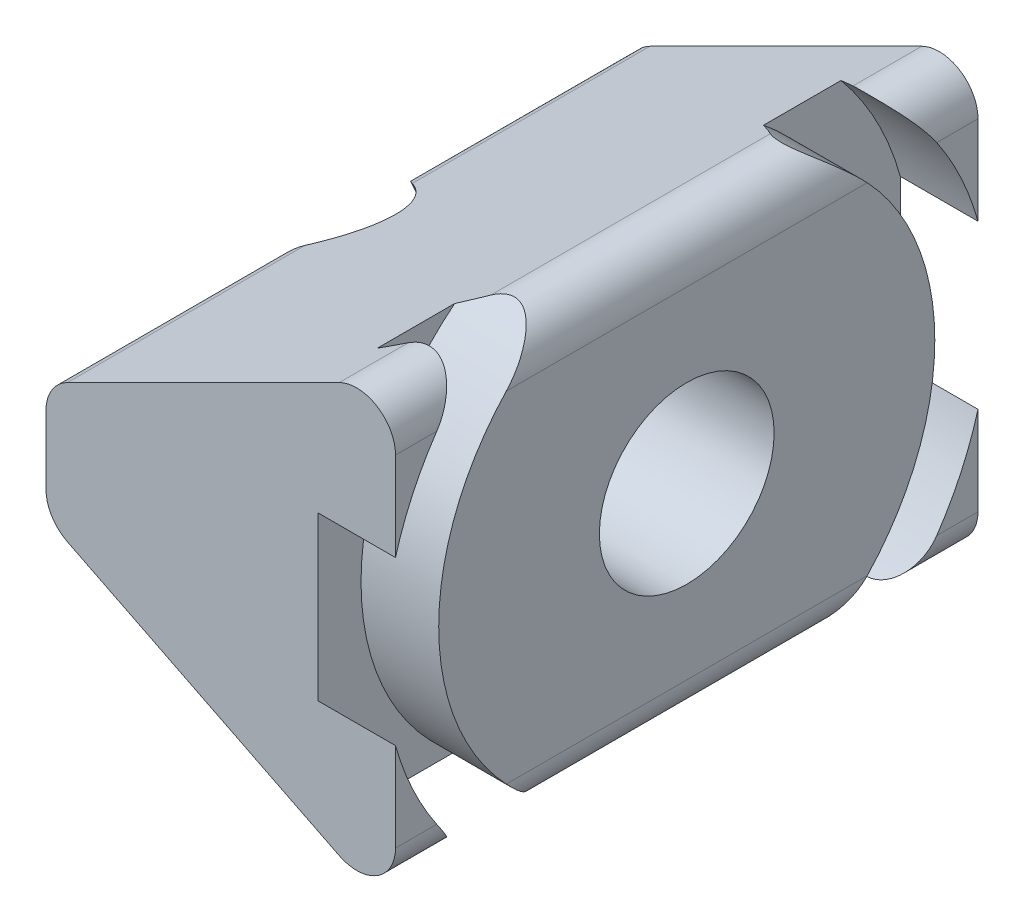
ISO-10303-21;
HEADER;
FILE_DESCRIPTION(('STEP AP214'),'2;1');
FILE_NAME('part.step','',(''),(''),'','','');
FILE_SCHEMA(('AUTOMOTIVE_DESIGN { 1 0 10303 214 1 1 1 1 }'));
ENDSEC;
DATA;
#1=APPLICATION_CONTEXT('core data for automotive mechanical design processes');
#2=APPLICATION_PROTOCOL_DEFINITION('international standard','automotive_design',2000,#1);
#3=PRODUCT_CONTEXT('',#1,'mechanical');
#4=PRODUCT('Part','Part','',(#3));
#5=PRODUCT_RELATED_PRODUCT_CATEGORY('part','',(#4));
#6=PRODUCT_DEFINITION_FORMATION('','',#4);
#7=PRODUCT_DEFINITION_CONTEXT('part definition',#1,'design');
#8=PRODUCT_DEFINITION('design','',#6,#7);
#9=PRODUCT_DEFINITION_SHAPE('','',#8);
#10=(LENGTH_UNIT() NAMED_UNIT(*) SI_UNIT(.MILLI.,.METRE.));
#11=(NAMED_UNIT(*) PLANE_ANGLE_UNIT() SI_UNIT($,.RADIAN.));
#12=(NAMED_UNIT(*) SI_UNIT($,.STERADIAN.) SOLID_ANGLE_UNIT());
#13=UNCERTAINTY_MEASURE_WITH_UNIT(LENGTH_MEASURE(1.E-05),#10,'distance_accuracy_value','');
#14=(GEOMETRIC_REPRESENTATION_CONTEXT(3) GLOBAL_UNCERTAINTY_ASSIGNED_CONTEXT((#13)) GLOBAL_UNIT_ASSIGNED_CONTEXT((#10,
#11,#12)) REPRESENTATION_CONTEXT('',''));
#15=CARTESIAN_POINT('',(0.,0.,0.));
#16=DIRECTION('',(0.,0.,1.));
#17=DIRECTION('',(1.,0.,0.));
#18=AXIS2_PLACEMENT_3D('',#15,#16,#17);
#19=CARTESIAN_POINT('',(-9.,0.,15.));
#20=DIRECTION('',(1.,0.,0.));
#21=DIRECTION('',(0.,0.,-1.));
#22=AXIS2_PLACEMENT_3D('',#19,#20,#21);
#23=PLANE('',#22);
#24=DIRECTION('',(0.,0.,-1.));
#25=VECTOR('',#24,1.);
#26=CARTESIAN_POINT('',(-9.,0.881966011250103,15.));
#27=LINE('',#26,#25);
#28=CARTESIAN_POINT('',(-9.,0.881966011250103,15.));
#29=VERTEX_POINT('',#28);
#30=CARTESIAN_POINT('',(-9.,0.881966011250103,9.56993622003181));
#31=VERTEX_POINT('',#30);
#32=EDGE_CURVE('E237',#29,#31,#27,.T.);
#33=ORIENTED_EDGE('',*,*,#32,.T.);
#34=CARTESIAN_POINT('',(-9.,0.,7.5));
#35=DIRECTION('',(1.,0.,0.));
#36=DIRECTION('',(0.,1.,0.));
#37=AXIS2_PLACEMENT_3D('',#34,#35,#36);
#38=CIRCLE('',#37,2.25);
#39=CARTESIAN_POINT('',(-9.,-0.881966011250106,9.56993622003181));
#40=VERTEX_POINT('',#39);
#41=EDGE_CURVE('E52',#31,#40,#38,.T.);
#42=ORIENTED_EDGE('',*,*,#41,.T.);
#43=DIRECTION('',(0.,0.,-1.));
#44=VECTOR('',#43,1.);
#45=CARTESIAN_POINT('',(-9.,-0.881966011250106,15.));
#46=LINE('',#45,#44);
#47=CARTESIAN_POINT('',(-9.,-0.881966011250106,15.));
#48=VERTEX_POINT('',#47);
#49=EDGE_CURVE('E234',#40,#48,#46,.F.);
#50=ORIENTED_EDGE('',*,*,#49,.T.);
#51=DIRECTION('',(0.,-1.,0.));
#52=VECTOR('',#51,1.);
#53=CARTESIAN_POINT('',(-9.,0.,15.));
#54=LINE('',#53,#52);
#55=EDGE_CURVE('E441',#29,#48,#54,.T.);
#56=ORIENTED_EDGE('',*,*,#55,.F.);
#57=EDGE_LOOP('',(#33,#42,#50,#56));
#58=FACE_BOUND('',#57,.T.);
#59=ADVANCED_FACE('F31',(#58),#23,.F.);
#60=CARTESIAN_POINT('',(-8.,-0.881966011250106,15.));
#61=DIRECTION('',(0.,0.,1.));
#62=DIRECTION('',(1.,0.,0.));
#63=AXIS2_PLACEMENT_3D('',#60,#61,#62);
#64=CYLINDRICAL_SURFACE('',#63,1.);
#65=CARTESIAN_POINT('',(-8.44721359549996,-1.77639320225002,8.8809153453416));
#66=CARTESIAN_POINT('',(-8.48022546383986,-1.75985632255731,8.90220934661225));
#67=CARTESIAN_POINT('',(-8.5117373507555,-1.74184496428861,8.92457038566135));
#68=CARTESIAN_POINT('',(-8.57188576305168,-1.70308703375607,8.97067460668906));
#69=CARTESIAN_POINT('',(-8.6005253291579,-1.68234340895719,8.99441628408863));
#70=CARTESIAN_POINT('',(-8.65530812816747,-1.63814967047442,9.04274124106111));
#71=CARTESIAN_POINT('',(-8.68143318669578,-1.61468221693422,9.06732912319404));
#72=CARTESIAN_POINT('',(-8.73099497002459,-1.56524652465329,9.11670184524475));
#73=CARTESIAN_POINT('',(-8.7544309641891,-1.53927760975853,9.14148673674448));
#74=CARTESIAN_POINT('',(-8.81656464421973,-1.46271400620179,9.21096514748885));
#75=CARTESIAN_POINT('',(-8.85213696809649,-1.40929609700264,9.25542425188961));
#76=CARTESIAN_POINT('',(-8.91295974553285,-1.29507931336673,9.34129004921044));
#77=CARTESIAN_POINT('',(-8.93825899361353,-1.23431715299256,9.38271038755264));
#78=CARTESIAN_POINT('',(-8.97112487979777,-1.12513805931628,9.44919122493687));
#79=CARTESIAN_POINT('',(-8.98172220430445,-1.07837749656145,9.47546969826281));
#80=CARTESIAN_POINT('',(-8.99617759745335,-0.982054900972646,9.5251076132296));
#81=CARTESIAN_POINT('',(-9.00000219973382,-0.932480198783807,9.54845203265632));
#82=CARTESIAN_POINT('',(-9.,-0.881966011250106,9.56993622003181));
#83=B_SPLINE_CURVE_WITH_KNOTS('',3,(#65,#66,#67,#68,#69,#70,#71,#72,#73,#74,#75,#76,#77,#78,#79,
#80,#81,#82),.UNSPECIFIED.,.F.,.F.,(4,2,2,2,2,2,2,2,4),(0.,0.127720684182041,0.255304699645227,
0.383750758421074,0.512231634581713,0.745406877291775,0.977461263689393,1.14095718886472,
1.30525877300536),.UNSPECIFIED.);
#84=CARTESIAN_POINT('',(-8.44721359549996,-1.77639320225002,8.8809153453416));
#85=VERTEX_POINT('',#84);
#86=EDGE_CURVE('E220',#85,#40,#83,.T.);
#87=ORIENTED_EDGE('',*,*,#86,.F.);
#88=DIRECTION('',(0.,0.,-1.));
#89=VECTOR('',#88,1.);
#90=CARTESIAN_POINT('',(-8.44721359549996,-1.77639320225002,0.));
#91=LINE('',#90,#89);
#92=CARTESIAN_POINT('',(-8.44721359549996,-1.77639320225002,15.));
#93=VERTEX_POINT('',#92);
#94=EDGE_CURVE('E453',#93,#85,#91,.T.);
#95=ORIENTED_EDGE('',*,*,#94,.F.);
#96=CARTESIAN_POINT('',(-8.,-0.881966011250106,15.));
#97=DIRECTION('',(0.,0.,-1.));
#98=DIRECTION('',(-1.,0.,0.));
#99=AXIS2_PLACEMENT_3D('',#96,#97,#98);
#100=CIRCLE('',#99,1.);
#101=EDGE_CURVE('E243',#48,#93,#100,.F.);
#102=ORIENTED_EDGE('',*,*,#101,.F.);
#103=ORIENTED_EDGE('',*,*,#49,.F.);
#104=EDGE_LOOP('',(#87,#95,#102,#103));
#105=FACE_BOUND('',#104,.T.);
#106=ADVANCED_FACE('F242',(#105),#64,.T.);
#107=CARTESIAN_POINT('',(-8.,0.881966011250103,15.));
#108=DIRECTION('',(0.,0.,-1.));
#109=DIRECTION('',(-1.,0.,0.));
#110=AXIS2_PLACEMENT_3D('',#107,#108,#109);
#111=CYLINDRICAL_SURFACE('',#110,1.);
#112=CARTESIAN_POINT('',(-8.44721359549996,1.77639320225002,6.1190846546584));
#113=CARTESIAN_POINT('',(-8.48022546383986,1.75985632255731,6.09779065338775));
#114=CARTESIAN_POINT('',(-8.5117373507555,1.7418449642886,6.07542961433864));
#115=CARTESIAN_POINT('',(-8.57188576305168,1.70308703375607,6.02932539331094));
#116=CARTESIAN_POINT('',(-8.6005253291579,1.68234340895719,6.00558371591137));
#117=CARTESIAN_POINT('',(-8.65530812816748,1.63814967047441,5.95725875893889));
#118=CARTESIAN_POINT('',(-8.68143318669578,1.61468221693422,5.93267087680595));
#119=CARTESIAN_POINT('',(-8.73099497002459,1.56524652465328,5.88329815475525));
#120=CARTESIAN_POINT('',(-8.75443096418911,1.53927760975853,5.85851326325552));
#121=CARTESIAN_POINT('',(-8.81656464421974,1.46271400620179,5.78903485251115));
#122=CARTESIAN_POINT('',(-8.85213696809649,1.40929609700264,5.74457574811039));
#123=CARTESIAN_POINT('',(-8.91295974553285,1.29507931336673,5.65870995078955));
#124=CARTESIAN_POINT('',(-8.93825899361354,1.23431715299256,5.61728961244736));
#125=CARTESIAN_POINT('',(-8.97112487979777,1.12513805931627,5.55080877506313));
#126=CARTESIAN_POINT('',(-8.98172220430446,1.07837749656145,5.52453030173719));
#127=CARTESIAN_POINT('',(-8.99617759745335,0.982054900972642,5.4748923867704));
#128=CARTESIAN_POINT('',(-9.00000219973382,0.932480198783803,5.45154796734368));
#129=CARTESIAN_POINT('',(-9.,0.881966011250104,5.43006377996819));
#130=B_SPLINE_CURVE_WITH_KNOTS('',3,(#112,#113,#114,#115,#116,#117,#118,#119,#120,#121,#122,
#123,#124,#125,#126,#127,#128,#129),.UNSPECIFIED.,.F.,.F.,(4,2,2,2,2,2,2,2,4),(0.,
0.127720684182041,0.255304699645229,0.383750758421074,0.512231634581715,0.745406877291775,
0.977461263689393,1.14095718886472,1.30525877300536),.UNSPECIFIED.);
#131=CARTESIAN_POINT('',(-8.44721359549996,1.77639320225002,6.1190846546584));
#132=VERTEX_POINT('',#131);
#133=CARTESIAN_POINT('',(-9.,0.881966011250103,5.43006377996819));
#134=VERTEX_POINT('',#133);
#135=EDGE_CURVE('E11',#132,#134,#130,.T.);
#136=ORIENTED_EDGE('',*,*,#135,.F.);
#137=DIRECTION('',(0.,0.,-1.));
#138=VECTOR('',#137,1.);
#139=CARTESIAN_POINT('',(-8.44721359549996,1.77639320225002,15.));
#140=LINE('',#139,#138);
#141=CARTESIAN_POINT('',(-8.44721359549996,1.77639320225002,0.));
#142=VERTEX_POINT('',#141);
#143=EDGE_CURVE('E264',#142,#132,#140,.F.);
#144=ORIENTED_EDGE('',*,*,#143,.F.);
#145=CARTESIAN_POINT('',(-8.,0.881966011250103,0.));
#146=DIRECTION('',(0.,0.,-1.));
#147=DIRECTION('',(-1.,0.,0.));
#148=AXIS2_PLACEMENT_3D('',#145,#146,#147);
#149=CIRCLE('',#148,1.);
#150=CARTESIAN_POINT('',(-9.,0.881966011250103,0.));
#151=VERTEX_POINT('',#150);
#152=EDGE_CURVE('E460',#151,#142,#149,.T.);
#153=ORIENTED_EDGE('',*,*,#152,.F.);
#154=EDGE_CURVE('E248',#134,#151,#27,.T.);
#155=ORIENTED_EDGE('',*,*,#154,.F.);
#156=EDGE_LOOP('',(#136,#144,#153,#155));
#157=FACE_BOUND('',#156,.T.);
#158=ADVANCED_FACE('F474',(#157),#111,.T.);
#159=CARTESIAN_POINT('',(0.,6.,15.));
#160=DIRECTION('',(-1.,0.,0.));
#161=DIRECTION('',(0.,-1.,0.));
#162=AXIS2_PLACEMENT_3D('',#159,#160,#161);
#163=PLANE('',#162);
#164=DIRECTION('',(0.,0.,-1.));
#165=VECTOR('',#164,1.);
#166=CARTESIAN_POINT('',(0.,-4.3819660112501,0.));
#167=LINE('',#166,#165);
#168=CARTESIAN_POINT('',(0.,-4.3819660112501,15.));
#169=VERTEX_POINT('',#168);
#170=CARTESIAN_POINT('',(0.,-4.3819660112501,13.9376359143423));
#171=VERTEX_POINT('',#170);
#172=EDGE_CURVE('E273',#169,#171,#167,.T.);
#173=ORIENTED_EDGE('',*,*,#172,.T.);
#174=CARTESIAN_POINT('',(0.,0.,7.5));
#175=DIRECTION('',(1.,0.,0.));
#176=DIRECTION('',(0.,1.,0.));
#177=AXIS2_PLACEMENT_3D('',#174,#175,#176);
#178=CIRCLE('',#177,7.78747598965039);
#179=CARTESIAN_POINT('',(0.,-2.09637360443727,15.));
#180=VERTEX_POINT('',#179);
#181=EDGE_CURVE('E404',#180,#171,#178,.T.);
#182=ORIENTED_EDGE('',*,*,#181,.F.);
#183=DIRECTION('',(0.,1.,0.));
#184=VECTOR('',#183,1.);
#185=CARTESIAN_POINT('',(0.,6.,15.));
#186=LINE('',#185,#184);
#187=EDGE_CURVE('E510',#169,#180,#186,.T.);
#188=ORIENTED_EDGE('',*,*,#187,.F.);
#189=EDGE_LOOP('',(#173,#182,#188));
#190=FACE_BOUND('',#189,.T.);
#191=ADVANCED_FACE('F556',(#190),#163,.F.);
#192=DIRECTION('',(0.,0.,-1.));
#193=VECTOR('',#192,1.);
#194=CARTESIAN_POINT('',(0.,4.38196601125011,15.));
#195=LINE('',#194,#193);
#196=CARTESIAN_POINT('',(0.,4.38196601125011,0.));
#197=VERTEX_POINT('',#196);
#198=CARTESIAN_POINT('',(0.,4.38196601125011,1.06236408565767));
#199=VERTEX_POINT('',#198);
#200=EDGE_CURVE('E268',#197,#199,#195,.F.);
#201=ORIENTED_EDGE('',*,*,#200,.T.);
#202=CARTESIAN_POINT('',(0.,2.09637360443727,0.));
#203=VERTEX_POINT('',#202);
#204=EDGE_CURVE('E388',#203,#199,#178,.T.);
#205=ORIENTED_EDGE('',*,*,#204,.F.);
#206=DIRECTION('',(0.,1.,0.));
#207=VECTOR('',#206,1.);
#208=CARTESIAN_POINT('',(0.,6.,0.));
#209=LINE('',#208,#207);
#210=EDGE_CURVE('E434',#203,#197,#209,.T.);
#211=ORIENTED_EDGE('',*,*,#210,.T.);
#212=EDGE_LOOP('',(#201,#205,#211));
#213=FACE_BOUND('',#212,.T.);
#214=ADVANCED_FACE('F489',(#213),#163,.F.);
#215=CARTESIAN_POINT('',(0.,0.,7.5));
#216=DIRECTION('',(1.,0.,0.));
#217=DIRECTION('',(0.,1.,0.));
#218=AXIS2_PLACEMENT_3D('',#215,#216,#217);
#219=CIRCLE('',#218,2.25);
#220=CARTESIAN_POINT('',(0.,2.25,7.5));
#221=VERTEX_POINT('',#220);
#222=EDGE_CURVE('E582',#221,#221,#219,.T.);
#223=ORIENTED_EDGE('',*,*,#222,.F.);
#224=EDGE_LOOP('',(#223));
#225=FACE_BOUND('',#224,.T.);
#226=CARTESIAN_POINT('',(0.,0.,7.5));
#227=DIRECTION('',(1.,0.,0.));
#228=DIRECTION('',(0.,1.,0.));
#229=AXIS2_PLACEMENT_3D('',#226,#227,#228);
#230=CIRCLE('',#229,6.38747598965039);
#231=CARTESIAN_POINT('',(0.,4.38196601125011,12.1473888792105));
#232=VERTEX_POINT('',#231);
#233=CARTESIAN_POINT('',(0.,-4.3819660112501,12.1473888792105));
#234=VERTEX_POINT('',#233);
#235=EDGE_CURVE('E393',#232,#234,#230,.T.);
#236=ORIENTED_EDGE('',*,*,#235,.T.);
#237=CARTESIAN_POINT('',(0.,-4.3819660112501,2.85261112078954));
#238=VERTEX_POINT('',#237);
#239=EDGE_CURVE('E277',#234,#238,#167,.T.);
#240=ORIENTED_EDGE('',*,*,#239,.T.);
#241=CARTESIAN_POINT('',(0.,4.38196601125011,2.85261112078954));
#242=VERTEX_POINT('',#241);
#243=EDGE_CURVE('E229',#238,#242,#230,.T.);
#244=ORIENTED_EDGE('',*,*,#243,.T.);
#245=EDGE_CURVE('E272',#242,#232,#195,.F.);
#246=ORIENTED_EDGE('',*,*,#245,.T.);
#247=EDGE_LOOP('',(#236,#240,#244,#246));
#248=FACE_BOUND('',#247,.T.);
#249=ADVANCED_FACE('F541',(#225,#248),#163,.F.);
#250=CARTESIAN_POINT('',(0.,2.09637360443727,15.));
#251=VERTEX_POINT('',#250);
#252=CARTESIAN_POINT('',(0.,4.38196601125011,15.));
#253=VERTEX_POINT('',#252);
#254=EDGE_CURVE('E446',#251,#253,#186,.T.);
#255=ORIENTED_EDGE('',*,*,#254,.F.);
#256=CARTESIAN_POINT('',(0.,4.38196601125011,13.9376359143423));
#257=VERTEX_POINT('',#256);
#258=EDGE_CURVE('E392',#257,#251,#178,.T.);
#259=ORIENTED_EDGE('',*,*,#258,.F.);
#260=EDGE_CURVE('E267',#257,#253,#195,.F.);
#261=ORIENTED_EDGE('',*,*,#260,.T.);
#262=EDGE_LOOP('',(#255,#259,#261));
#263=FACE_BOUND('',#262,.T.);
#264=ADVANCED_FACE('F544',(#263),#163,.F.);
#265=CARTESIAN_POINT('',(-1.,-4.3819660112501,15.));
#266=DIRECTION('',(0.,0.,1.));
#267=DIRECTION('',(1.,0.,0.));
#268=AXIS2_PLACEMENT_3D('',#265,#266,#267);
#269=CYLINDRICAL_SURFACE('',#268,1.);
#270=ORIENTED_EDGE('',*,*,#239,.F.);
#271=CARTESIAN_POINT('',(0.,-4.3819660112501,12.1473888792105));
#272=CARTESIAN_POINT('',(-1.24990088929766E-05,-4.421813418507,12.1098257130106));
#273=CARTESIAN_POINT('',(-0.00238111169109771,-4.46115226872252,12.0717575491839));
#274=CARTESIAN_POINT('',(-0.0115664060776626,-4.5385668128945,11.9949096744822));
#275=CARTESIAN_POINT('',(-0.0183811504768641,-4.57664304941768,11.9561302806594));
#276=CARTESIAN_POINT('',(-0.0363107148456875,-4.65180644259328,11.8776185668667));
#277=CARTESIAN_POINT('',(-0.0474802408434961,-4.68887432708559,11.8378804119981));
#278=CARTESIAN_POINT('',(-0.0739455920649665,-4.76132229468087,11.7582339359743));
#279=CARTESIAN_POINT('',(-0.0892418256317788,-4.79670221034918,11.7183255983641));
#280=CARTESIAN_POINT('',(-0.124071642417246,-4.86597973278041,11.6382272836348));
#281=CARTESIAN_POINT('',(-0.143649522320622,-4.89985702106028,11.5980389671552));
#282=CARTESIAN_POINT('',(-0.186978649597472,-4.96552754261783,11.5182154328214));
#283=CARTESIAN_POINT('',(-0.210729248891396,-4.99732109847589,11.4785801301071));
#284=CARTESIAN_POINT('',(-0.262441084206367,-5.05842794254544,11.4005892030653));
#285=CARTESIAN_POINT('',(-0.290378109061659,-5.0877540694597,11.3622276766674));
#286=CARTESIAN_POINT('',(-0.350875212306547,-5.14376354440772,11.2873112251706));
#287=CARTESIAN_POINT('',(-0.383429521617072,-5.17045012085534,11.2507541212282));
#288=CARTESIAN_POINT('',(-0.447600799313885,-5.21630862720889,11.1866309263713));
#289=CARTESIAN_POINT('',(-0.478396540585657,-5.23598036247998,11.1586067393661));
#290=CARTESIAN_POINT('',(-0.543943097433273,-5.27270958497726,11.1054715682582));
#291=CARTESIAN_POINT('',(-0.578697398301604,-5.28976473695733,11.0803631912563));
#292=CARTESIAN_POINT('',(-0.653007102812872,-5.32071065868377,11.0342141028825));
#293=CARTESIAN_POINT('',(-0.692626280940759,-5.33455053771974,11.0132395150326));
#294=CARTESIAN_POINT('',(-0.776043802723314,-5.35751236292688,10.9781257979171));
#295=CARTESIAN_POINT('',(-0.819825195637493,-5.36665254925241,10.9639602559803));
#296=CARTESIAN_POINT('',(-0.895009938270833,-5.37690311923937,10.9480166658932));
#297=CARTESIAN_POINT('',(-0.925646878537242,-5.37967769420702,10.9436785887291));
#298=CARTESIAN_POINT('',(-0.987321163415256,-5.38235979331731,10.9394854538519));
#299=CARTESIAN_POINT('',(-1.01835781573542,-5.38227174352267,10.9396234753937));
#300=CARTESIAN_POINT('',(-1.07985143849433,-5.37924755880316,10.9443506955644));
#301=CARTESIAN_POINT('',(-1.11030973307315,-5.37631901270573,10.9489280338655));
#302=CARTESIAN_POINT('',(-1.1700914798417,-5.36785925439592,10.9620799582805));
#303=CARTESIAN_POINT('',(-1.1994093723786,-5.36231669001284,10.9706719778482));
#304=CARTESIAN_POINT('',(-1.26832437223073,-5.34619221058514,10.9954788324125));
#305=CARTESIAN_POINT('',(-1.30702894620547,-5.33447050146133,11.0133806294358));
#306=CARTESIAN_POINT('',(-1.38021440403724,-5.30767787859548,11.053731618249));
#307=CARTESIAN_POINT('',(-1.41473432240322,-5.29264232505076,11.0761325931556));
#308=CARTESIAN_POINT('',(-1.44721359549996,-5.27639320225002,11.0999339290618));
#309=B_SPLINE_CURVE_WITH_KNOTS('',3,(#271,#272,#273,#274,#275,#276,#277,#278,#279,#280,#281,
#282,#283,#284,#285,#286,#287,#288,#289,#290,#291,#292,#293,#294,#295,#296,#297,#298,#299,#300,
#301,#302,#303,#304,#305,#306,#307,#308),.UNSPECIFIED.,.F.,.F.,(4,2,2,2,2,2,2,2,2,2,2,2,2,2,2,2,
2,2,4),(0.,0.164195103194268,0.328318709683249,0.494574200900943,0.660846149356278,
0.828927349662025,0.996982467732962,1.16410072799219,1.33101199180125,1.46890142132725,
1.60691320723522,1.74697967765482,1.886498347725,1.97928083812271,2.0719198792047,
2.16431210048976,2.2571093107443,2.38912662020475,2.51979813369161),.UNSPECIFIED.);
#310=CARTESIAN_POINT('',(-1.44721359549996,-5.27639320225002,11.0999339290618));
#311=VERTEX_POINT('',#310);
#312=EDGE_CURVE('E328',#234,#311,#309,.T.);
#313=ORIENTED_EDGE('',*,*,#312,.T.);
#314=DIRECTION('',(0.,0.,-1.));
#315=VECTOR('',#314,1.);
#316=CARTESIAN_POINT('',(-1.44721359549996,-5.27639320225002,15.));
#317=LINE('',#316,#315);
#318=CARTESIAN_POINT('',(-1.44721359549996,-5.27639320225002,3.90006607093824));
#319=VERTEX_POINT('',#318);
#320=EDGE_CURVE('E451',#319,#311,#317,.F.);
#321=ORIENTED_EDGE('',*,*,#320,.F.);
#322=CARTESIAN_POINT('',(-1.44721359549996,-5.27639320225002,3.90006607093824));
#323=CARTESIAN_POINT('',(-1.41906915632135,-5.29045968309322,3.92067424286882));
#324=CARTESIAN_POINT('',(-1.38947830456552,-5.30359780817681,3.9401999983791));
#325=CARTESIAN_POINT('',(-1.32703524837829,-5.32758049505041,3.97619600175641));
#326=CARTESIAN_POINT('',(-1.29414303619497,-5.33839020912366,3.99261942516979));
#327=CARTESIAN_POINT('',(-1.2252545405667,-5.35692115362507,4.0209857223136));
#328=CARTESIAN_POINT('',(-1.18923594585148,-5.36461750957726,4.03289246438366));
#329=CARTESIAN_POINT('',(-1.11529566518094,-5.37599370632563,4.05055718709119));
#330=CARTESIAN_POINT('',(-1.07738771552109,-5.37969907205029,4.05635423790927));
#331=CARTESIAN_POINT('',(-1.0053957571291,-5.38252373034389,4.06077145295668));
#332=CARTESIAN_POINT('',(-0.971376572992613,-5.38212387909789,4.06014414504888));
#333=CARTESIAN_POINT('',(-0.904025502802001,-5.37792321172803,4.05358076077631));
#334=CARTESIAN_POINT('',(-0.870695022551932,-5.37411603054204,4.04763474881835));
#335=CARTESIAN_POINT('',(-0.801257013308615,-5.36273404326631,4.02997768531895));
#336=CARTESIAN_POINT('',(-0.76540104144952,-5.35471179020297,4.01758426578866));
#337=CARTESIAN_POINT('',(-0.696562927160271,-5.33549052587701,3.98820580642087));
#338=CARTESIAN_POINT('',(-0.663585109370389,-5.32428683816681,3.97121400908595));
#339=CARTESIAN_POINT('',(-0.583889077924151,-5.29275919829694,3.92400840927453));
#340=CARTESIAN_POINT('',(-0.539176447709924,-5.27075181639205,3.89156548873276));
#341=CARTESIAN_POINT('',(-0.456094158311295,-5.22249188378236,3.82206128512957));
#342=CARTESIAN_POINT('',(-0.41774182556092,-5.1962281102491,3.78498785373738));
#343=CARTESIAN_POINT('',(-0.353036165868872,-5.1453859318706,3.71497964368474));
#344=CARTESIAN_POINT('',(-0.325763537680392,-5.1213459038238,3.68249018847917));
#345=CARTESIAN_POINT('',(-0.274696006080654,-5.07132210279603,3.61628153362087));
#346=CARTESIAN_POINT('',(-0.250903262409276,-5.04533713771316,3.58256158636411));
#347=CARTESIAN_POINT('',(-0.184367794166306,-4.96472912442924,3.48019530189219));
#348=CARTESIAN_POINT('',(-0.146507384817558,-4.90748519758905,3.41038744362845));
#349=CARTESIAN_POINT('',(-0.0817528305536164,-4.78431989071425,3.26685247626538));
#350=CARTESIAN_POINT('',(-0.0554728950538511,-4.71811375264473,3.19309819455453));
#351=CARTESIAN_POINT('',(-0.0173182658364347,-4.58048285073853,3.04702168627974));
#352=CARTESIAN_POINT('',(-0.00539673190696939,-4.50907586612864,2.97469556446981));
#353=CARTESIAN_POINT('',(-0.000490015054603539,-4.41797436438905,2.88675988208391));
#354=CARTESIAN_POINT('',(-2.18269841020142E-06,-4.40001886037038,2.86963014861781));
#355=CARTESIAN_POINT('',(0.,-4.3819660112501,2.85261112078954));
#356=B_SPLINE_CURVE_WITH_KNOTS('',3,(#322,#323,#324,#325,#326,#327,#328,#329,#330,#331,#332,
#333,#334,#335,#336,#337,#338,#339,#340,#341,#342,#343,#344,#345,#346,#347,#348,#349,#350,#351,
#352,#353,#354,#355),.UNSPECIFIED.,.F.,.F.,(4,2,2,2,2,2,2,2,2,2,2,2,2,2,2,2,4),(0.,
0.113000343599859,0.227589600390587,0.343077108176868,0.457821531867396,0.559294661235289,
0.660957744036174,0.776651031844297,0.89251526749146,1.06992123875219,1.24780282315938,
1.39387727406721,1.54004200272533,1.83257311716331,2.13915771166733,2.44473942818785,
2.51918204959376),.UNSPECIFIED.);
#357=EDGE_CURVE('E305',#319,#238,#356,.T.);
#358=ORIENTED_EDGE('',*,*,#357,.T.);
#359=EDGE_LOOP('',(#270,#313,#321,#358));
#360=FACE_BOUND('',#359,.T.);
#361=ADVANCED_FACE('F320',(#360),#269,.T.);
#362=CARTESIAN_POINT('',(0.,-4.3819660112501,13.9376359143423));
#363=CARTESIAN_POINT('',(-5.60146233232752E-06,-4.41701432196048,13.9137814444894));
#364=CARTESIAN_POINT('',(-0.00184259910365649,-4.45184148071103,13.8896537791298));
#365=CARTESIAN_POINT('',(-0.00908203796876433,-4.52084686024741,13.8410175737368));
#366=CARTESIAN_POINT('',(-0.0144839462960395,-4.55502517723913,13.8165090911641));
#367=CARTESIAN_POINT('',(-0.0359619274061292,-4.65662390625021,13.7424081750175));
#368=CARTESIAN_POINT('',(-0.057308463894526,-4.72276023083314,13.6924774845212));
#369=CARTESIAN_POINT('',(-0.113099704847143,-4.84900477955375,13.5941186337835));
#370=CARTESIAN_POINT('',(-0.147386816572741,-4.90917494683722,13.5456796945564));
#371=CARTESIAN_POINT('',(-0.22896742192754,-5.02256464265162,13.451806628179));
#372=CARTESIAN_POINT('',(-0.27622724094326,-5.07580164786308,13.4063650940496));
#373=CARTESIAN_POINT('',(-0.366282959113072,-5.15706947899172,13.3353511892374));
#374=CARTESIAN_POINT('',(-0.405494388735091,-5.18765351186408,13.3081371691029));
#375=CARTESIAN_POINT('',(-0.489844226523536,-5.24352871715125,13.2577422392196));
#376=CARTESIAN_POINT('',(-0.534972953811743,-5.26882836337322,13.2345548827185));
#377=CARTESIAN_POINT('',(-0.621445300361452,-5.30851869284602,13.1978066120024));
#378=CARTESIAN_POINT('',(-0.66182720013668,-5.32407334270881,13.1832509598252));
#379=CARTESIAN_POINT('',(-0.745568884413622,-5.35004731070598,13.1588069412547));
#380=CARTESIAN_POINT('',(-0.78892660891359,-5.36047014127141,13.148915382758));
#381=CARTESIAN_POINT('',(-0.877845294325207,-5.37550627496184,13.1346097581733));
#382=CARTESIAN_POINT('',(-0.923418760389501,-5.38008131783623,13.1302317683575));
#383=CARTESIAN_POINT('',(-1.01493501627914,-5.38290041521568,13.1275368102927));
#384=CARTESIAN_POINT('',(-1.06087765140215,-5.3811469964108,13.1292174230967));
#385=CARTESIAN_POINT('',(-1.14676174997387,-5.37198259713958,13.1379621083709));
#386=CARTESIAN_POINT('',(-1.18683150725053,-5.36517711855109,13.1444498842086));
#387=CARTESIAN_POINT('',(-1.26500636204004,-5.34704711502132,13.1616272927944));
#388=CARTESIAN_POINT('',(-1.30311070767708,-5.33572087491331,13.1723185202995));
#389=CARTESIAN_POINT('',(-1.35850285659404,-5.31570572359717,13.1910578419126));
#390=CARTESIAN_POINT('',(-1.37678891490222,-5.30847100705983,13.1978090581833));
#391=CARTESIAN_POINT('',(-1.41257770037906,-5.29309546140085,13.212095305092));
#392=CARTESIAN_POINT('',(-1.43008288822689,-5.28495780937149,13.2196275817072));
#393=CARTESIAN_POINT('',(-1.44721359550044,-5.27639320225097,13.2275175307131));
#394=B_SPLINE_CURVE_WITH_KNOTS('',3,(#362,#363,#364,#365,#366,#367,#368,#369,#370,#371,#372,
#373,#374,#375,#376,#377,#378,#379,#380,#381,#382,#383,#384,#385,#386,#387,#388,#389,#390,#391,
#392,#393),.UNSPECIFIED.,.F.,.F.,(4,2,2,2,2,2,2,2,2,2,2,2,2,2,2,4),(0.,0.127093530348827,
0.254168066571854,0.509564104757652,0.761945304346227,1.01367746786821,1.18318155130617,
1.35241170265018,1.48884123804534,1.62517726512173,1.76240080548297,1.89956956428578,
2.02251490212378,2.14550692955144,2.20784130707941,2.26996292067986),.UNSPECIFIED.);
#395=CARTESIAN_POINT('',(-1.44721359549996,-5.27639320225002,13.2275175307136));
#396=VERTEX_POINT('',#395);
#397=EDGE_CURVE('E601',#171,#396,#394,.T.);
#398=ORIENTED_EDGE('',*,*,#397,.F.);
#399=ORIENTED_EDGE('',*,*,#172,.F.);
#400=CARTESIAN_POINT('',(-1.,-4.3819660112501,15.));
#401=DIRECTION('',(0.,0.,-1.));
#402=DIRECTION('',(-1.,0.,0.));
#403=AXIS2_PLACEMENT_3D('',#400,#401,#402);
#404=CIRCLE('',#403,1.);
#405=CARTESIAN_POINT('',(-1.44721359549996,-5.27639320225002,15.));
#406=VERTEX_POINT('',#405);
#407=EDGE_CURVE('E253',#406,#169,#404,.F.);
#408=ORIENTED_EDGE('',*,*,#407,.F.);
#409=EDGE_CURVE('E452',#396,#406,#317,.F.);
#410=ORIENTED_EDGE('',*,*,#409,.F.);
#411=EDGE_LOOP('',(#398,#399,#408,#410));
#412=FACE_BOUND('',#411,.T.);
#413=ADVANCED_FACE('F321',(#412),#269,.T.);
#414=CARTESIAN_POINT('',(-1.,4.38196601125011,15.));
#415=DIRECTION('',(0.,0.,-1.));
#416=DIRECTION('',(-1.,0.,0.));
#417=AXIS2_PLACEMENT_3D('',#414,#415,#416);
#418=CYLINDRICAL_SURFACE('',#417,1.);
#419=ORIENTED_EDGE('',*,*,#245,.F.);
#420=CARTESIAN_POINT('',(0.,4.38196601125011,2.85261112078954));
#421=CARTESIAN_POINT('',(-1.24990088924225E-05,4.421813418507,2.8901742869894));
#422=CARTESIAN_POINT('',(-0.00238111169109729,4.46115226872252,2.92824245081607));
#423=CARTESIAN_POINT('',(-0.0115664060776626,4.5385668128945,3.00509032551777));
#424=CARTESIAN_POINT('',(-0.0183811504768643,4.57664304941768,3.04386971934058));
#425=CARTESIAN_POINT('',(-0.0363107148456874,4.65180644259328,3.12238143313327));
#426=CARTESIAN_POINT('',(-0.0474802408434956,4.68887432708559,3.16211958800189));
#427=CARTESIAN_POINT('',(-0.0739455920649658,4.76132229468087,3.24176606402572));
#428=CARTESIAN_POINT('',(-0.0892418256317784,4.79670221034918,3.2816744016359));
#429=CARTESIAN_POINT('',(-0.124071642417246,4.86597973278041,3.36177271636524));
#430=CARTESIAN_POINT('',(-0.143649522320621,4.89985702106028,3.40196103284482));
#431=CARTESIAN_POINT('',(-0.186978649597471,4.96552754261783,3.48178456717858));
#432=CARTESIAN_POINT('',(-0.210729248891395,4.99732109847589,3.52141986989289));
#433=CARTESIAN_POINT('',(-0.262441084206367,5.05842794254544,3.59941079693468));
#434=CARTESIAN_POINT('',(-0.290378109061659,5.0877540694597,3.63777232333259));
#435=CARTESIAN_POINT('',(-0.350875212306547,5.14376354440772,3.71268877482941));
#436=CARTESIAN_POINT('',(-0.383429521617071,5.17045012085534,3.74924587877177));
#437=CARTESIAN_POINT('',(-0.447600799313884,5.21630862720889,3.81336907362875));
#438=CARTESIAN_POINT('',(-0.478396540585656,5.23598036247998,3.8413932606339));
#439=CARTESIAN_POINT('',(-0.543943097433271,5.27270958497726,3.89452843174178));
#440=CARTESIAN_POINT('',(-0.578697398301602,5.28976473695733,3.91963680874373));
#441=CARTESIAN_POINT('',(-0.65300710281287,5.32071065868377,3.96578589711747));
#442=CARTESIAN_POINT('',(-0.692626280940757,5.33455053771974,3.98676048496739));
#443=CARTESIAN_POINT('',(-0.776043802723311,5.35751236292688,4.02187420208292));
#444=CARTESIAN_POINT('',(-0.819825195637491,5.36665254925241,4.03603974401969));
#445=CARTESIAN_POINT('',(-0.89500993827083,5.37690311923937,4.05198333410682));
#446=CARTESIAN_POINT('',(-0.925646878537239,5.37967769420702,4.05632141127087));
#447=CARTESIAN_POINT('',(-0.987321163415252,5.38235979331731,4.06051454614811));
#448=CARTESIAN_POINT('',(-1.01835781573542,5.38227174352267,4.06037652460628));
#449=CARTESIAN_POINT('',(-1.07985143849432,5.37924755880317,4.05564930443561));
#450=CARTESIAN_POINT('',(-1.11030973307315,5.37631901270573,4.05107196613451));
#451=CARTESIAN_POINT('',(-1.1700914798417,5.36785925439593,4.03792004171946));
#452=CARTESIAN_POINT('',(-1.19940937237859,5.36231669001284,4.02932802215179));
#453=CARTESIAN_POINT('',(-1.26832437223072,5.34619221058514,4.00452116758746));
#454=CARTESIAN_POINT('',(-1.30702894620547,5.33447050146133,3.9866193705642));
#455=CARTESIAN_POINT('',(-1.38021440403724,5.30767787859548,3.94626838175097));
#456=CARTESIAN_POINT('',(-1.41473432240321,5.29264232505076,3.92386740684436));
#457=CARTESIAN_POINT('',(-1.44721359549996,5.27639320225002,3.90006607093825));
#458=B_SPLINE_CURVE_WITH_KNOTS('',3,(#420,#421,#422,#423,#424,#425,#426,#427,#428,#429,#430,
#431,#432,#433,#434,#435,#436,#437,#438,#439,#440,#441,#442,#443,#444,#445,#446,#447,#448,#449,
#450,#451,#452,#453,#454,#455,#456,#457),.UNSPECIFIED.,.F.,.F.,(4,2,2,2,2,2,2,2,2,2,2,2,2,2,2,2,
2,2,4),(0.,0.164195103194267,0.328318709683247,0.49457420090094,0.660846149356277,
0.828927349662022,0.996982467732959,1.16410072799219,1.33101199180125,1.46890142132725,
1.60691320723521,1.74697967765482,1.886498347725,1.9792808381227,2.0719198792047,
2.16431210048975,2.2571093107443,2.38912662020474,2.51979813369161),.UNSPECIFIED.);
#459=CARTESIAN_POINT('',(-1.44721359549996,5.27639320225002,3.90006607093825));
#460=VERTEX_POINT('',#459);
#461=EDGE_CURVE('E284',#242,#460,#458,.T.);
#462=ORIENTED_EDGE('',*,*,#461,.T.);
#463=DIRECTION('',(0.,0.,-1.));
#464=VECTOR('',#463,1.);
#465=CARTESIAN_POINT('',(-1.44721359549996,5.27639320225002,15.));
#466=LINE('',#465,#464);
#467=CARTESIAN_POINT('',(-1.44721359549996,5.27639320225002,11.0999339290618));
#468=VERTEX_POINT('',#467);
#469=EDGE_CURVE('E263',#468,#460,#466,.T.);
#470=ORIENTED_EDGE('',*,*,#469,.F.);
#471=CARTESIAN_POINT('',(-1.44721359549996,5.27639320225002,11.0999339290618));
#472=CARTESIAN_POINT('',(-1.41906915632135,5.29045968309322,11.0793257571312));
#473=CARTESIAN_POINT('',(-1.38947830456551,5.30359780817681,11.0598000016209));
#474=CARTESIAN_POINT('',(-1.32703524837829,5.32758049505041,11.0238039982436));
#475=CARTESIAN_POINT('',(-1.29414303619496,5.33839020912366,11.0073805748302));
#476=CARTESIAN_POINT('',(-1.2252545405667,5.35692115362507,10.9790142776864));
#477=CARTESIAN_POINT('',(-1.18923594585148,5.36461750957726,10.9671075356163));
#478=CARTESIAN_POINT('',(-1.11529566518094,5.37599370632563,10.9494428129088));
#479=CARTESIAN_POINT('',(-1.07738771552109,5.37969907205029,10.9436457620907));
#480=CARTESIAN_POINT('',(-1.0053957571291,5.38252373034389,10.9392285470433));
#481=CARTESIAN_POINT('',(-0.971376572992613,5.38212387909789,10.9398558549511));
#482=CARTESIAN_POINT('',(-0.904025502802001,5.37792321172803,10.9464192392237));
#483=CARTESIAN_POINT('',(-0.870695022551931,5.37411603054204,10.9523652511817));
#484=CARTESIAN_POINT('',(-0.801257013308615,5.36273404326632,10.9700223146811));
#485=CARTESIAN_POINT('',(-0.765401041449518,5.35471179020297,10.9824157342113));
#486=CARTESIAN_POINT('',(-0.696562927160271,5.33549052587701,11.0117941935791));
#487=CARTESIAN_POINT('',(-0.663585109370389,5.32428683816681,11.0287859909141));
#488=CARTESIAN_POINT('',(-0.583889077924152,5.29275919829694,11.0759915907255));
#489=CARTESIAN_POINT('',(-0.539176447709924,5.27075181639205,11.1084345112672));
#490=CARTESIAN_POINT('',(-0.456094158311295,5.22249188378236,11.1779387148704));
#491=CARTESIAN_POINT('',(-0.417741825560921,5.1962281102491,11.2150121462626));
#492=CARTESIAN_POINT('',(-0.353036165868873,5.1453859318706,11.2850203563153));
#493=CARTESIAN_POINT('',(-0.325763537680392,5.1213459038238,11.3175098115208));
#494=CARTESIAN_POINT('',(-0.274696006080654,5.07132210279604,11.3837184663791));
#495=CARTESIAN_POINT('',(-0.250903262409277,5.04533713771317,11.4174384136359));
#496=CARTESIAN_POINT('',(-0.184367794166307,4.96472912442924,11.5198046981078));
#497=CARTESIAN_POINT('',(-0.146507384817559,4.90748519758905,11.5896125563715));
#498=CARTESIAN_POINT('',(-0.0817528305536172,4.78431989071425,11.7331475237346));
#499=CARTESIAN_POINT('',(-0.0554728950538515,4.71811375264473,11.8069018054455));
#500=CARTESIAN_POINT('',(-0.0173182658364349,4.58048285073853,11.9529783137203));
#501=CARTESIAN_POINT('',(-0.00539673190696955,4.50907586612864,12.0253044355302));
#502=CARTESIAN_POINT('',(-0.000490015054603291,4.41797436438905,12.1132401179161));
#503=CARTESIAN_POINT('',(-2.18269840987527E-06,4.40001886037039,12.1303698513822));
#504=CARTESIAN_POINT('',(0.,4.38196601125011,12.1473888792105));
#505=B_SPLINE_CURVE_WITH_KNOTS('',3,(#471,#472,#473,#474,#475,#476,#477,#478,#479,#480,#481,
#482,#483,#484,#485,#486,#487,#488,#489,#490,#491,#492,#493,#494,#495,#496,#497,#498,#499,#500,
#501,#502,#503,#504),.UNSPECIFIED.,.F.,.F.,(4,2,2,2,2,2,2,2,2,2,2,2,2,2,2,2,4),(0.,
0.11300034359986,0.227589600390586,0.343077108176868,0.457821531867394,0.559294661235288,
0.660957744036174,0.776651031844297,0.892515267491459,1.06992123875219,1.24780282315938,
1.39387727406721,1.54004200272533,1.83257311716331,2.13915771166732,2.44473942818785,
2.51918204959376),.UNSPECIFIED.);
#506=EDGE_CURVE('E276',#468,#232,#505,.T.);
#507=ORIENTED_EDGE('',*,*,#506,.T.);
#508=EDGE_LOOP('',(#419,#462,#470,#507));
#509=FACE_BOUND('',#508,.T.);
#510=ADVANCED_FACE('F535',(#509),#418,.T.);
#511=CARTESIAN_POINT('',(0.,4.38196601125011,1.06236408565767));
#512=CARTESIAN_POINT('',(-5.60146233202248E-06,4.41701432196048,1.08621855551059));
#513=CARTESIAN_POINT('',(-0.00184259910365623,4.45184148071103,1.11034622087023));
#514=CARTESIAN_POINT('',(-0.00908203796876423,4.52084686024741,1.15898242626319));
#515=CARTESIAN_POINT('',(-0.0144839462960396,4.55502517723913,1.1834909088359));
#516=CARTESIAN_POINT('',(-0.0359619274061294,4.65662390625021,1.25759182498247));
#517=CARTESIAN_POINT('',(-0.0573084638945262,4.72276023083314,1.30752251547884));
#518=CARTESIAN_POINT('',(-0.113099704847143,4.84900477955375,1.40588136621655));
#519=CARTESIAN_POINT('',(-0.147386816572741,4.90917494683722,1.45432030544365));
#520=CARTESIAN_POINT('',(-0.22896742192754,5.02256464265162,1.54819337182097));
#521=CARTESIAN_POINT('',(-0.27622724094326,5.07580164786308,1.59363490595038));
#522=CARTESIAN_POINT('',(-0.366282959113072,5.15706947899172,1.66464881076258));
#523=CARTESIAN_POINT('',(-0.405494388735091,5.18765351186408,1.69186283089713));
#524=CARTESIAN_POINT('',(-0.489844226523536,5.24352871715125,1.74225776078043));
#525=CARTESIAN_POINT('',(-0.534972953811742,5.26882836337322,1.76544511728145));
#526=CARTESIAN_POINT('',(-0.621445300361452,5.30851869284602,1.80219338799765));
#527=CARTESIAN_POINT('',(-0.661827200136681,5.32407334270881,1.81674904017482));
#528=CARTESIAN_POINT('',(-0.745568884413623,5.35004731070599,1.84119305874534));
#529=CARTESIAN_POINT('',(-0.78892660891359,5.36047014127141,1.851084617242));
#530=CARTESIAN_POINT('',(-0.877845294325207,5.37550627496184,1.86539024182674));
#531=CARTESIAN_POINT('',(-0.923418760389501,5.38008131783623,1.86976823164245));
#532=CARTESIAN_POINT('',(-1.01493501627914,5.38290041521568,1.87246318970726));
#533=CARTESIAN_POINT('',(-1.06087765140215,5.3811469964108,1.87078257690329));
#534=CARTESIAN_POINT('',(-1.14676174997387,5.37198259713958,1.86203789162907));
#535=CARTESIAN_POINT('',(-1.18683150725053,5.36517711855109,1.85555011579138));
#536=CARTESIAN_POINT('',(-1.26500636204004,5.34704711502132,1.83837270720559));
#537=CARTESIAN_POINT('',(-1.30311070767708,5.33572087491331,1.82768147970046));
#538=CARTESIAN_POINT('',(-1.35850285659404,5.31570572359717,1.80894215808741));
#539=CARTESIAN_POINT('',(-1.37678891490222,5.30847100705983,1.80219094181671));
#540=CARTESIAN_POINT('',(-1.41257770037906,5.29309546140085,1.78790469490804));
#541=CARTESIAN_POINT('',(-1.43008288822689,5.28495780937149,1.78037241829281));
#542=CARTESIAN_POINT('',(-1.44721359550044,5.27639320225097,1.77248246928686));
#543=B_SPLINE_CURVE_WITH_KNOTS('',3,(#511,#512,#513,#514,#515,#516,#517,#518,#519,#520,#521,
#522,#523,#524,#525,#526,#527,#528,#529,#530,#531,#532,#533,#534,#535,#536,#537,#538,#539,#540,
#541,#542),.UNSPECIFIED.,.F.,.F.,(4,2,2,2,2,2,2,2,2,2,2,2,2,2,2,4),(0.,0.127093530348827,
0.254168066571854,0.509564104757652,0.761945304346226,1.01367746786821,1.18318155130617,
1.35241170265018,1.48884123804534,1.62517726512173,1.76240080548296,1.89956956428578,
2.02251490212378,2.14550692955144,2.2078413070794,2.26996292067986),.UNSPECIFIED.);
#544=CARTESIAN_POINT('',(-1.44721359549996,5.27639320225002,1.77248246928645));
#545=VERTEX_POINT('',#544);
#546=EDGE_CURVE('E358',#199,#545,#543,.T.);
#547=ORIENTED_EDGE('',*,*,#546,.F.);
#548=ORIENTED_EDGE('',*,*,#200,.F.);
#549=CARTESIAN_POINT('',(-1.,4.38196601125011,0.));
#550=DIRECTION('',(0.,0.,-1.));
#551=DIRECTION('',(-1.,0.,0.));
#552=AXIS2_PLACEMENT_3D('',#549,#550,#551);
#553=CIRCLE('',#552,1.);
#554=CARTESIAN_POINT('',(-1.44721359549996,5.27639320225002,0.));
#555=VERTEX_POINT('',#554);
#556=EDGE_CURVE('E455',#555,#197,#553,.T.);
#557=ORIENTED_EDGE('',*,*,#556,.F.);
#558=EDGE_CURVE('E258',#545,#555,#466,.T.);
#559=ORIENTED_EDGE('',*,*,#558,.F.);
#560=EDGE_LOOP('',(#547,#548,#557,#559));
#561=FACE_BOUND('',#560,.T.);
#562=ADVANCED_FACE('F485',(#561),#418,.T.);
#563=CARTESIAN_POINT('',(0.,-4.3819660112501,0.));
#564=VERTEX_POINT('',#563);
#565=CARTESIAN_POINT('',(0.,-2.09637360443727,0.));
#566=VERTEX_POINT('',#565);
#567=EDGE_CURVE('E427',#564,#566,#209,.T.);
#568=ORIENTED_EDGE('',*,*,#567,.T.);
#569=CARTESIAN_POINT('',(0.,-4.3819660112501,1.06236408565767));
#570=VERTEX_POINT('',#569);
#571=EDGE_CURVE('E391',#570,#566,#178,.T.);
#572=ORIENTED_EDGE('',*,*,#571,.F.);
#573=EDGE_CURVE('E271',#570,#564,#167,.T.);
#574=ORIENTED_EDGE('',*,*,#573,.T.);
#575=EDGE_LOOP('',(#568,#572,#574));
#576=FACE_BOUND('',#575,.T.);
#577=ADVANCED_FACE('F431',(#576),#163,.F.);
#578=CARTESIAN_POINT('',(-9.,1.5,15.));
#579=DIRECTION('',(0.447213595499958,-0.894427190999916,0.));
#580=DIRECTION('',(0.894427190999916,0.447213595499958,0.));
#581=AXIS2_PLACEMENT_3D('',#578,#579,#580);
#582=PLANE('',#581);
#583=ORIENTED_EDGE('',*,*,#143,.T.);
#584=CARTESIAN_POINT('',(-12.,0.,7.5));
#585=DIRECTION('',(0.447213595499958,-0.894427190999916,0.));
#586=DIRECTION('',(0.894427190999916,0.447213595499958,0.));
#587=AXIS2_PLACEMENT_3D('',#584,#585,#586);
#588=ELLIPSE('',#587,5.03115294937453,2.25);
#589=CARTESIAN_POINT('',(-8.44721359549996,1.77639320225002,8.88091534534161));
#590=VERTEX_POINT('',#589);
#591=EDGE_CURVE('E238',#132,#590,#588,.T.);
#592=ORIENTED_EDGE('',*,*,#591,.T.);
#593=CARTESIAN_POINT('',(-8.44721359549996,1.77639320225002,15.));
#594=VERTEX_POINT('',#593);
#595=EDGE_CURVE('E262',#590,#594,#140,.F.);
#596=ORIENTED_EDGE('',*,*,#595,.T.);
#597=DIRECTION('',(-0.894427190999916,-0.447213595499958,0.));
#598=VECTOR('',#597,1.);
#599=CARTESIAN_POINT('',(-9.,1.5,15.));
#600=LINE('',#599,#598);
#601=CARTESIAN_POINT('',(-1.44721359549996,5.27639320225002,15.));
#602=VERTEX_POINT('',#601);
#603=EDGE_CURVE('E512',#602,#594,#600,.T.);
#604=ORIENTED_EDGE('',*,*,#603,.F.);
#605=CARTESIAN_POINT('',(-1.44721359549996,5.27639320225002,13.2275175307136));
#606=VERTEX_POINT('',#605);
#607=EDGE_CURVE('E259',#602,#606,#466,.T.);
#608=ORIENTED_EDGE('',*,*,#607,.T.);
#609=CARTESIAN_POINT('',(-12.,0.,7.5));
#610=DIRECTION('',(0.447213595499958,-0.894427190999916,0.));
#611=DIRECTION('',(0.894427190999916,0.447213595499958,0.));
#612=AXIS2_PLACEMENT_3D('',#609,#610,#611);
#613=ELLIPSE('',#612,17.4133256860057,7.78747598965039);
#614=CARTESIAN_POINT('',(-2.,5.,13.4703251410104));
#615=VERTEX_POINT('',#614);
#616=EDGE_CURVE('E341',#606,#615,#613,.T.);
#617=ORIENTED_EDGE('',*,*,#616,.T.);
#618=DIRECTION('',(0.,0.,1.));
#619=VECTOR('',#618,1.);
#620=CARTESIAN_POINT('',(-2.,5.,15.));
#621=LINE('',#620,#619);
#622=CARTESIAN_POINT('',(-2.,5.,11.4749024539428));
#623=VERTEX_POINT('',#622);
#624=EDGE_CURVE('E503',#623,#615,#621,.T.);
#625=ORIENTED_EDGE('',*,*,#624,.F.);
#626=CARTESIAN_POINT('',(-12.,0.,7.5));
#627=DIRECTION('',(0.447213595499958,-0.894427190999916,0.));
#628=DIRECTION('',(0.894427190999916,0.447213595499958,0.));
#629=AXIS2_PLACEMENT_3D('',#626,#627,#628);
#630=ELLIPSE('',#629,14.282830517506,6.38747598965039);
#631=EDGE_CURVE('E313',#468,#623,#630,.T.);
#632=ORIENTED_EDGE('',*,*,#631,.F.);
#633=ORIENTED_EDGE('',*,*,#469,.T.);
#634=CARTESIAN_POINT('',(-2.,5.,3.52509754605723));
#635=VERTEX_POINT('',#634);
#636=EDGE_CURVE('E60',#635,#460,#630,.T.);
#637=ORIENTED_EDGE('',*,*,#636,.F.);
#638=CARTESIAN_POINT('',(-2.,5.,1.52967485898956));
#639=VERTEX_POINT('',#638);
#640=EDGE_CURVE('E505',#639,#635,#621,.T.);
#641=ORIENTED_EDGE('',*,*,#640,.F.);
#642=EDGE_CURVE('E340',#639,#545,#613,.T.);
#643=ORIENTED_EDGE('',*,*,#642,.T.);
#644=ORIENTED_EDGE('',*,*,#558,.T.);
#645=DIRECTION('',(-0.894427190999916,-0.447213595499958,0.));
#646=VECTOR('',#645,1.);
#647=CARTESIAN_POINT('',(-9.,1.5,0.));
#648=LINE('',#647,#646);
#649=EDGE_CURVE('E433',#555,#142,#648,.T.);
#650=ORIENTED_EDGE('',*,*,#649,.T.);
#651=EDGE_LOOP('',(#583,#592,#596,#604,#608,#617,#625,#632,#633,#637,#641,#643,#644,#650));
#652=FACE_BOUND('',#651,.T.);
#653=ADVANCED_FACE('F477',(#652),#582,.F.);
#654=CARTESIAN_POINT('',(-9.,-0.881966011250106,0.));
#655=VERTEX_POINT('',#654);
#656=CARTESIAN_POINT('',(-9.,-0.881966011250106,5.43006377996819));
#657=VERTEX_POINT('',#656);
#658=EDGE_CURVE('E244',#655,#657,#46,.F.);
#659=ORIENTED_EDGE('',*,*,#658,.T.);
#660=EDGE_CURVE('E239',#657,#134,#38,.T.);
#661=ORIENTED_EDGE('',*,*,#660,.T.);
#662=ORIENTED_EDGE('',*,*,#154,.T.);
#663=DIRECTION('',(0.,-1.,0.));
#664=VECTOR('',#663,1.);
#665=CARTESIAN_POINT('',(-9.,0.,0.));
#666=LINE('',#665,#664);
#667=EDGE_CURVE('E437',#151,#655,#666,.T.);
#668=ORIENTED_EDGE('',*,*,#667,.T.);
#669=EDGE_LOOP('',(#659,#661,#662,#668));
#670=FACE_BOUND('',#669,.T.);
#671=ADVANCED_FACE('F469',(#670),#23,.F.);
#672=CARTESIAN_POINT('',(-9.,0.,15.));
#673=DIRECTION('',(0.,0.,-1.));
#674=DIRECTION('',(-1.,0.,0.));
#675=AXIS2_PLACEMENT_3D('',#672,#673,#674);
#676=PLANE('',#675);
#677=DIRECTION('',(0.,-1.,0.));
#678=VECTOR('',#677,1.);
#679=CARTESIAN_POINT('',(-2.,0.,15.));
#680=LINE('',#679,#678);
#681=CARTESIAN_POINT('',(-2.,2.09637360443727,15.));
#682=VERTEX_POINT('',#681);
#683=CARTESIAN_POINT('',(-2.,-2.09637360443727,15.));
#684=VERTEX_POINT('',#683);
#685=EDGE_CURVE('E501',#682,#684,#680,.T.);
#686=ORIENTED_EDGE('',*,*,#685,.F.);
#687=DIRECTION('',(1.,0.,0.));
#688=VECTOR('',#687,1.);
#689=CARTESIAN_POINT('',(-2.,2.09637360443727,15.));
#690=LINE('',#689,#688);
#691=EDGE_CURVE('E496',#682,#251,#690,.T.);
#692=ORIENTED_EDGE('',*,*,#691,.T.);
#693=ORIENTED_EDGE('',*,*,#254,.T.);
#694=CARTESIAN_POINT('',(-1.,4.38196601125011,15.));
#695=DIRECTION('',(0.,0.,-1.));
#696=DIRECTION('',(-1.,0.,0.));
#697=AXIS2_PLACEMENT_3D('',#694,#695,#696);
#698=CIRCLE('',#697,1.);
#699=EDGE_CURVE('E247',#253,#602,#698,.F.);
#700=ORIENTED_EDGE('',*,*,#699,.T.);
#701=ORIENTED_EDGE('',*,*,#603,.T.);
#702=CARTESIAN_POINT('',(-8.,0.881966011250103,15.));
#703=DIRECTION('',(0.,0.,-1.));
#704=DIRECTION('',(-1.,0.,0.));
#705=AXIS2_PLACEMENT_3D('',#702,#703,#704);
#706=CIRCLE('',#705,1.);
#707=EDGE_CURVE('E255',#594,#29,#706,.F.);
#708=ORIENTED_EDGE('',*,*,#707,.T.);
#709=ORIENTED_EDGE('',*,*,#55,.T.);
#710=ORIENTED_EDGE('',*,*,#101,.T.);
#711=DIRECTION('',(-0.894427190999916,0.447213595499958,0.));
#712=VECTOR('',#711,1.);
#713=CARTESIAN_POINT('',(-9.,-1.5,15.));
#714=LINE('',#713,#712);
#715=EDGE_CURVE('E439',#406,#93,#714,.T.);
#716=ORIENTED_EDGE('',*,*,#715,.F.);
#717=ORIENTED_EDGE('',*,*,#407,.T.);
#718=ORIENTED_EDGE('',*,*,#187,.T.);
#719=DIRECTION('',(1.,0.,0.));
#720=VECTOR('',#719,1.);
#721=CARTESIAN_POINT('',(-2.,-2.09637360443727,15.));
#722=LINE('',#721,#720);
#723=EDGE_CURVE('E493',#180,#684,#722,.F.);
#724=ORIENTED_EDGE('',*,*,#723,.T.);
#725=EDGE_LOOP('',(#686,#692,#693,#700,#701,#708,#709,#710,#716,#717,#718,#724));
#726=FACE_BOUND('',#725,.T.);
#727=ADVANCED_FACE('F546',(#726),#676,.F.);
#728=CARTESIAN_POINT('',(-9.,0.,0.));
#729=DIRECTION('',(0.,0.,-1.));
#730=DIRECTION('',(-1.,0.,0.));
#731=AXIS2_PLACEMENT_3D('',#728,#729,#730);
#732=PLANE('',#731);
#733=DIRECTION('',(1.,0.,0.));
#734=VECTOR('',#733,1.);
#735=CARTESIAN_POINT('',(-2.,2.09637360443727,0.));
#736=LINE('',#735,#734);
#737=CARTESIAN_POINT('',(-2.,2.09637360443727,0.));
#738=VERTEX_POINT('',#737);
#739=EDGE_CURVE('E429',#738,#203,#736,.T.);
#740=ORIENTED_EDGE('',*,*,#739,.F.);
#741=DIRECTION('',(0.,-1.,0.));
#742=VECTOR('',#741,1.);
#743=CARTESIAN_POINT('',(-2.,0.,0.));
#744=LINE('',#743,#742);
#745=CARTESIAN_POINT('',(-2.,-2.09637360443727,0.));
#746=VERTEX_POINT('',#745);
#747=EDGE_CURVE('E428',#738,#746,#744,.T.);
#748=ORIENTED_EDGE('',*,*,#747,.T.);
#749=DIRECTION('',(1.,0.,0.));
#750=VECTOR('',#749,1.);
#751=CARTESIAN_POINT('',(-2.,-2.09637360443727,0.));
#752=LINE('',#751,#750);
#753=EDGE_CURVE('E416',#566,#746,#752,.F.);
#754=ORIENTED_EDGE('',*,*,#753,.F.);
#755=ORIENTED_EDGE('',*,*,#567,.F.);
#756=CARTESIAN_POINT('',(-1.,-4.3819660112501,0.));
#757=DIRECTION('',(0.,0.,-1.));
#758=DIRECTION('',(-1.,0.,0.));
#759=AXIS2_PLACEMENT_3D('',#756,#757,#758);
#760=CIRCLE('',#759,1.);
#761=CARTESIAN_POINT('',(-1.44721359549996,-5.27639320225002,0.));
#762=VERTEX_POINT('',#761);
#763=EDGE_CURVE('E458',#564,#762,#760,.T.);
#764=ORIENTED_EDGE('',*,*,#763,.T.);
#765=DIRECTION('',(-0.894427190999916,0.447213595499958,0.));
#766=VECTOR('',#765,1.);
#767=CARTESIAN_POINT('',(-9.,-1.5,0.));
#768=LINE('',#767,#766);
#769=CARTESIAN_POINT('',(-8.44721359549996,-1.77639320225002,0.));
#770=VERTEX_POINT('',#769);
#771=EDGE_CURVE('E508',#762,#770,#768,.T.);
#772=ORIENTED_EDGE('',*,*,#771,.T.);
#773=CARTESIAN_POINT('',(-8.,-0.881966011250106,0.));
#774=DIRECTION('',(0.,0.,-1.));
#775=DIRECTION('',(-1.,0.,0.));
#776=AXIS2_PLACEMENT_3D('',#773,#774,#775);
#777=CIRCLE('',#776,1.);
#778=EDGE_CURVE('E461',#770,#655,#777,.T.);
#779=ORIENTED_EDGE('',*,*,#778,.T.);
#780=ORIENTED_EDGE('',*,*,#667,.F.);
#781=ORIENTED_EDGE('',*,*,#152,.T.);
#782=ORIENTED_EDGE('',*,*,#649,.F.);
#783=ORIENTED_EDGE('',*,*,#556,.T.);
#784=ORIENTED_EDGE('',*,*,#210,.F.);
#785=EDGE_LOOP('',(#740,#748,#754,#755,#764,#772,#779,#780,#781,#782,#783,#784));
#786=FACE_BOUND('',#785,.T.);
#787=ADVANCED_FACE('F426',(#786),#732,.T.);
#788=CARTESIAN_POINT('',(-9.,-1.5,15.));
#789=DIRECTION('',(-0.447213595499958,-0.894427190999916,0.));
#790=DIRECTION('',(0.894427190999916,-0.447213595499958,0.));
#791=AXIS2_PLACEMENT_3D('',#788,#789,#790);
#792=PLANE('',#791);
#793=CARTESIAN_POINT('',(-12.,0.,7.5));
#794=DIRECTION('',(-0.447213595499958,-0.894427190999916,0.));
#795=DIRECTION('',(0.894427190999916,-0.447213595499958,0.));
#796=AXIS2_PLACEMENT_3D('',#793,#794,#795);
#797=ELLIPSE('',#796,5.03115294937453,2.25);
#798=CARTESIAN_POINT('',(-8.44721359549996,-1.77639320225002,6.1190846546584));
#799=VERTEX_POINT('',#798);
#800=EDGE_CURVE('E224',#799,#85,#797,.T.);
#801=ORIENTED_EDGE('',*,*,#800,.F.);
#802=EDGE_CURVE('E450',#799,#770,#91,.T.);
#803=ORIENTED_EDGE('',*,*,#802,.T.);
#804=ORIENTED_EDGE('',*,*,#771,.F.);
#805=CARTESIAN_POINT('',(-1.44721359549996,-5.27639320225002,1.77248246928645));
#806=VERTEX_POINT('',#805);
#807=EDGE_CURVE('E447',#762,#806,#317,.F.);
#808=ORIENTED_EDGE('',*,*,#807,.T.);
#809=CARTESIAN_POINT('',(-12.,0.,7.5));
#810=DIRECTION('',(-0.447213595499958,-0.894427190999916,0.));
#811=DIRECTION('',(0.894427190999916,-0.447213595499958,0.));
#812=AXIS2_PLACEMENT_3D('',#809,#810,#811);
#813=ELLIPSE('',#812,17.4133256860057,7.78747598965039);
#814=CARTESIAN_POINT('',(-2.,-5.,1.52967485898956));
#815=VERTEX_POINT('',#814);
#816=EDGE_CURVE('E339',#815,#806,#813,.T.);
#817=ORIENTED_EDGE('',*,*,#816,.F.);
#818=DIRECTION('',(0.,0.,1.));
#819=VECTOR('',#818,1.);
#820=CARTESIAN_POINT('',(-2.,-5.,15.));
#821=LINE('',#820,#819);
#822=CARTESIAN_POINT('',(-2.,-5.,3.52509754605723));
#823=VERTEX_POINT('',#822);
#824=EDGE_CURVE('E363',#815,#823,#821,.T.);
#825=ORIENTED_EDGE('',*,*,#824,.T.);
#826=CARTESIAN_POINT('',(-12.,0.,7.5));
#827=DIRECTION('',(-0.447213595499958,-0.894427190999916,0.));
#828=DIRECTION('',(0.894427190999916,-0.447213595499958,0.));
#829=AXIS2_PLACEMENT_3D('',#826,#827,#828);
#830=ELLIPSE('',#829,14.282830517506,6.38747598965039);
#831=EDGE_CURVE('E312',#823,#319,#830,.T.);
#832=ORIENTED_EDGE('',*,*,#831,.T.);
#833=ORIENTED_EDGE('',*,*,#320,.T.);
#834=CARTESIAN_POINT('',(-2.,-5.,11.4749024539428));
#835=VERTEX_POINT('',#834);
#836=EDGE_CURVE('E377',#311,#835,#830,.T.);
#837=ORIENTED_EDGE('',*,*,#836,.T.);
#838=CARTESIAN_POINT('',(-2.,-5.,13.4703251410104));
#839=VERTEX_POINT('',#838);
#840=EDGE_CURVE('E365',#835,#839,#821,.T.);
#841=ORIENTED_EDGE('',*,*,#840,.T.);
#842=EDGE_CURVE('E374',#396,#839,#813,.T.);
#843=ORIENTED_EDGE('',*,*,#842,.F.);
#844=ORIENTED_EDGE('',*,*,#409,.T.);
#845=ORIENTED_EDGE('',*,*,#715,.T.);
#846=ORIENTED_EDGE('',*,*,#94,.T.);
#847=EDGE_LOOP('',(#801,#803,#804,#808,#817,#825,#832,#833,#837,#841,#843,#844,#845,#846));
#848=FACE_BOUND('',#847,.T.);
#849=ADVANCED_FACE('F348',(#848),#792,.T.);
#850=CARTESIAN_POINT('',(-9.,-0.881966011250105,5.43006377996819));
#851=CARTESIAN_POINT('',(-9.00000015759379,-0.912889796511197,5.44323536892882));
#852=CARTESIAN_POINT('',(-8.99856564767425,-0.943487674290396,5.45709647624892));
#853=CARTESIAN_POINT('',(-8.9930114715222,-1.00380350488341,5.4860504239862));
#854=CARTESIAN_POINT('',(-8.98889497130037,-1.03352245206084,5.50114179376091));
#855=CARTESIAN_POINT('',(-8.97287510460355,-1.12067970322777,5.54784983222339));
#856=CARTESIAN_POINT('',(-8.95729549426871,-1.17659825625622,5.58110649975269));
#857=CARTESIAN_POINT('',(-8.91784220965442,-1.28293320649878,5.65051123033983));
#858=CARTESIAN_POINT('',(-8.89400968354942,-1.3333752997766,5.68664427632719));
#859=CARTESIAN_POINT('',(-8.83903622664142,-1.42883118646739,5.76086148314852));
#860=CARTESIAN_POINT('',(-8.80787115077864,-1.47382628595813,5.79895175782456));
#861=CARTESIAN_POINT('',(-8.75151308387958,-1.54258843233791,5.86163711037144));
#862=CARTESIAN_POINT('',(-8.72827742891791,-1.56811949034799,5.88609598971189));
#863=CARTESIAN_POINT('',(-8.67918636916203,-1.61674379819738,5.93480888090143));
#864=CARTESIAN_POINT('',(-8.65333136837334,-1.63983742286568,5.95906292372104));
#865=CARTESIAN_POINT('',(-8.59907505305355,-1.68341436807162,6.00679838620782));
#866=CARTESIAN_POINT('',(-8.57068376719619,-1.70390725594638,6.03028238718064));
#867=CARTESIAN_POINT('',(-8.51109118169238,-1.74221468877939,6.07588908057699));
#868=CARTESIAN_POINT('',(-8.479887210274,-1.76002664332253,6.09801044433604));
#869=CARTESIAN_POINT('',(-8.44721359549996,-1.77639320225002,6.1190846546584));
#870=B_SPLINE_CURVE_WITH_KNOTS('',3,(#850,#851,#852,#853,#854,#855,#856,#857,#858,#859,#860,
#861,#862,#863,#864,#865,#866,#867,#868,#869),.UNSPECIFIED.,.F.,.F.,(4,2,2,2,2,2,2,2,2,4),(0.,
0.10074679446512,0.20137487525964,0.401086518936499,0.599816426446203,0.799210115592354,
0.926001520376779,1.05277339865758,1.17906449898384,1.30547685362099),.UNSPECIFIED.);
#871=EDGE_CURVE('E576',#657,#799,#870,.T.);
#872=ORIENTED_EDGE('',*,*,#871,.F.);
#873=ORIENTED_EDGE('',*,*,#658,.F.);
#874=ORIENTED_EDGE('',*,*,#778,.F.);
#875=ORIENTED_EDGE('',*,*,#802,.F.);
#876=EDGE_LOOP('',(#872,#873,#874,#875));
#877=FACE_BOUND('',#876,.T.);
#878=ADVANCED_FACE('F550',(#877),#64,.T.);
#879=CARTESIAN_POINT('',(-9.,0.881966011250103,9.56993622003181));
#880=CARTESIAN_POINT('',(-9.00000015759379,0.912889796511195,9.55676463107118));
#881=CARTESIAN_POINT('',(-8.99856564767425,0.943487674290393,9.54290352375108));
#882=CARTESIAN_POINT('',(-8.9930114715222,1.0038035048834,9.5139495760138));
#883=CARTESIAN_POINT('',(-8.98889497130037,1.03352245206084,9.49885820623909));
#884=CARTESIAN_POINT('',(-8.97287510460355,1.12067970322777,9.45215016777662));
#885=CARTESIAN_POINT('',(-8.95729549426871,1.17659825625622,9.41889350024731));
#886=CARTESIAN_POINT('',(-8.91784220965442,1.28293320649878,9.34948876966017));
#887=CARTESIAN_POINT('',(-8.89400968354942,1.3333752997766,9.31335572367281));
#888=CARTESIAN_POINT('',(-8.83903622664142,1.42883118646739,9.23913851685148));
#889=CARTESIAN_POINT('',(-8.80787115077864,1.47382628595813,9.20104824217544));
#890=CARTESIAN_POINT('',(-8.75151308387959,1.54258843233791,9.13836288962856));
#891=CARTESIAN_POINT('',(-8.72827742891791,1.56811949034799,9.11390401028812));
#892=CARTESIAN_POINT('',(-8.67918636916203,1.61674379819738,9.06519111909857));
#893=CARTESIAN_POINT('',(-8.65333136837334,1.63983742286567,9.04093707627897));
#894=CARTESIAN_POINT('',(-8.59907505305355,1.68341436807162,8.99320161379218));
#895=CARTESIAN_POINT('',(-8.57068376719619,1.70390725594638,8.96971761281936));
#896=CARTESIAN_POINT('',(-8.51109118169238,1.74221468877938,8.92411091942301));
#897=CARTESIAN_POINT('',(-8.479887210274,1.76002664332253,8.90198955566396));
#898=CARTESIAN_POINT('',(-8.44721359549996,1.77639320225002,8.88091534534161));
#899=B_SPLINE_CURVE_WITH_KNOTS('',3,(#879,#880,#881,#882,#883,#884,#885,#886,#887,#888,#889,
#890,#891,#892,#893,#894,#895,#896,#897,#898),.UNSPECIFIED.,.F.,.F.,(4,2,2,2,2,2,2,2,2,4),(0.,
0.10074679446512,0.20137487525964,0.401086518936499,0.599816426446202,0.799210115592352,
0.926001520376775,1.05277339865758,1.17906449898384,1.30547685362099),.UNSPECIFIED.);
#900=EDGE_CURVE('E45',#31,#590,#899,.T.);
#901=ORIENTED_EDGE('',*,*,#900,.F.);
#902=ORIENTED_EDGE('',*,*,#32,.F.);
#903=ORIENTED_EDGE('',*,*,#707,.F.);
#904=ORIENTED_EDGE('',*,*,#595,.F.);
#905=EDGE_LOOP('',(#901,#902,#903,#904));
#906=FACE_BOUND('',#905,.T.);
#907=ADVANCED_FACE('F318',(#906),#111,.T.);
#908=CARTESIAN_POINT('',(-1.44721359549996,-5.27639320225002,1.77248246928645));
#909=CARTESIAN_POINT('',(-1.4105779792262,-5.29475180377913,1.78939762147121));
#910=CARTESIAN_POINT('',(-1.37206170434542,-5.31115211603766,1.80466796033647));
#911=CARTESIAN_POINT('',(-1.29186257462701,-5.33936529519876,1.83110711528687));
#912=CARTESIAN_POINT('',(-1.25016637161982,-5.35115739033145,1.84225734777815));
#913=CARTESIAN_POINT('',(-1.16431538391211,-5.36935453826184,1.85952362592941));
#914=CARTESIAN_POINT('',(-1.12014873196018,-5.37573068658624,1.86561265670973));
#915=CARTESIAN_POINT('',(-1.03105484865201,-5.38247752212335,1.87205697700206));
#916=CARTESIAN_POINT('',(-0.986130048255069,-5.38286470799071,1.87242801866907));
#917=CARTESIAN_POINT('',(-0.900337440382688,-5.37784501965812,1.86763166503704));
#918=CARTESIAN_POINT('',(-0.859419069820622,-5.37287266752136,1.86287961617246));
#919=CARTESIAN_POINT('',(-0.779223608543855,-5.3581437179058,1.84887798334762));
#920=CARTESIAN_POINT('',(-0.73994838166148,-5.34838183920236,1.83962343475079));
#921=CARTESIAN_POINT('',(-0.662590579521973,-5.32422569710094,1.81689484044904));
#922=CARTESIAN_POINT('',(-0.62459318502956,-5.30968601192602,1.80328874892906));
#923=CARTESIAN_POINT('',(-0.551747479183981,-5.27676769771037,1.77278342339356));
#924=CARTESIAN_POINT('',(-0.516900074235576,-5.25838796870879,1.75588324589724));
#925=CARTESIAN_POINT('',(-0.432999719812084,-5.2078099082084,1.70990561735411));
#926=CARTESIAN_POINT('',(-0.386183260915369,-5.17344481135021,1.67911562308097));
#927=CARTESIAN_POINT('',(-0.300511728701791,-5.09887376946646,1.61368145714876));
#928=CARTESIAN_POINT('',(-0.261678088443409,-5.05865258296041,1.57902728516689));
#929=CARTESIAN_POINT('',(-0.183294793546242,-4.96308552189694,1.49855357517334));
#930=CARTESIAN_POINT('',(-0.145956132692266,-4.90646252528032,1.45209644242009));
#931=CARTESIAN_POINT('',(-0.0836537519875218,-4.78790963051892,1.35781423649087));
#932=CARTESIAN_POINT('',(-0.0586848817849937,-4.72598195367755,1.30998974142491));
#933=CARTESIAN_POINT('',(-0.0268598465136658,-4.61694688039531,1.2284954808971));
#934=CARTESIAN_POINT('',(-0.0168450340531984,-4.57078423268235,1.19476512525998));
#935=CARTESIAN_POINT('',(-0.00342973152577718,-4.47720418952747,1.12797040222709));
#936=CARTESIAN_POINT('',(-1.40862374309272E-05,-4.42978992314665,1.09490468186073));
#937=CARTESIAN_POINT('',(0.,-4.3819660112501,1.06236408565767));
#938=B_SPLINE_CURVE_WITH_KNOTS('',3,(#908,#909,#910,#911,#912,#913,#914,#915,#916,#917,#918,
#919,#920,#921,#922,#923,#924,#925,#926,#927,#928,#929,#930,#931,#932,#933,#934,#935,#936,#937),
.UNSPECIFIED.,.F.,.F.,(4,2,2,2,2,2,2,2,2,2,2,2,2,2,4),(0.,0.133064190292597,0.266721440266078,
0.401087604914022,0.535083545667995,0.658979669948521,0.783012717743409,0.911238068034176,
1.03950019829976,1.23561011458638,1.43223988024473,1.67763532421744,1.92292850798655,
2.09668731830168,2.27004660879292),.UNSPECIFIED.);
#939=EDGE_CURVE('E334',#806,#570,#938,.T.);
#940=ORIENTED_EDGE('',*,*,#939,.F.);
#941=ORIENTED_EDGE('',*,*,#807,.F.);
#942=ORIENTED_EDGE('',*,*,#763,.F.);
#943=ORIENTED_EDGE('',*,*,#573,.F.);
#944=EDGE_LOOP('',(#940,#941,#942,#943));
#945=FACE_BOUND('',#944,.T.);
#946=ADVANCED_FACE('F315',(#945),#269,.T.);
#947=CARTESIAN_POINT('',(-1.44721359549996,5.27639320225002,13.2275175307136));
#948=CARTESIAN_POINT('',(-1.4105779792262,5.29475180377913,13.2106023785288));
#949=CARTESIAN_POINT('',(-1.37206170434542,5.31115211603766,13.1953320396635));
#950=CARTESIAN_POINT('',(-1.29186257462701,5.33936529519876,13.1688928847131));
#951=CARTESIAN_POINT('',(-1.25016637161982,5.35115739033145,13.1577426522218));
#952=CARTESIAN_POINT('',(-1.16431538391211,5.36935453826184,13.1404763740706));
#953=CARTESIAN_POINT('',(-1.12014873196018,5.37573068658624,13.1343873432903));
#954=CARTESIAN_POINT('',(-1.03105484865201,5.38247752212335,13.1279430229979));
#955=CARTESIAN_POINT('',(-0.986130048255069,5.38286470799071,13.1275719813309));
#956=CARTESIAN_POINT('',(-0.900337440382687,5.37784501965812,13.132368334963));
#957=CARTESIAN_POINT('',(-0.859419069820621,5.37287266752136,13.1371203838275));
#958=CARTESIAN_POINT('',(-0.779223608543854,5.3581437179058,13.1511220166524));
#959=CARTESIAN_POINT('',(-0.739948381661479,5.34838183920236,13.1603765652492));
#960=CARTESIAN_POINT('',(-0.662590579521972,5.32422569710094,13.183105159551));
#961=CARTESIAN_POINT('',(-0.624593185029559,5.30968601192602,13.1967112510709));
#962=CARTESIAN_POINT('',(-0.55174747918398,5.27676769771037,13.2272165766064));
#963=CARTESIAN_POINT('',(-0.516900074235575,5.25838796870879,13.2441167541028));
#964=CARTESIAN_POINT('',(-0.432999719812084,5.2078099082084,13.2900943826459));
#965=CARTESIAN_POINT('',(-0.386183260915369,5.17344481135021,13.320884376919));
#966=CARTESIAN_POINT('',(-0.300511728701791,5.09887376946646,13.3863185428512));
#967=CARTESIAN_POINT('',(-0.261678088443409,5.05865258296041,13.4209727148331));
#968=CARTESIAN_POINT('',(-0.183294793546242,4.96308552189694,13.5014464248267));
#969=CARTESIAN_POINT('',(-0.145956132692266,4.90646252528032,13.5479035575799));
#970=CARTESIAN_POINT('',(-0.0836537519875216,4.78790963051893,13.6421857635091));
#971=CARTESIAN_POINT('',(-0.0586848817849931,4.72598195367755,13.6900102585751));
#972=CARTESIAN_POINT('',(-0.0268598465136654,4.61694688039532,13.7715045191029));
#973=CARTESIAN_POINT('',(-0.0168450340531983,4.57078423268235,13.80523487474));
#974=CARTESIAN_POINT('',(-0.00342973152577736,4.47720418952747,13.8720295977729));
#975=CARTESIAN_POINT('',(-1.40862374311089E-05,4.42978992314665,13.9050953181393));
#976=CARTESIAN_POINT('',(0.,4.38196601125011,13.9376359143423));
#977=B_SPLINE_CURVE_WITH_KNOTS('',3,(#947,#948,#949,#950,#951,#952,#953,#954,#955,#956,#957,
#958,#959,#960,#961,#962,#963,#964,#965,#966,#967,#968,#969,#970,#971,#972,#973,#974,#975,#976),
.UNSPECIFIED.,.F.,.F.,(4,2,2,2,2,2,2,2,2,2,2,2,2,2,4),(0.,0.133064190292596,0.266721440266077,
0.401087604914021,0.535083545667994,0.65897966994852,0.783012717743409,0.911238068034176,
1.03950019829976,1.23561011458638,1.43223988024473,1.67763532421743,1.92292850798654,
2.09668731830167,2.27004660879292),.UNSPECIFIED.);
#978=EDGE_CURVE('E352',#606,#257,#977,.T.);
#979=ORIENTED_EDGE('',*,*,#978,.F.);
#980=ORIENTED_EDGE('',*,*,#607,.F.);
#981=ORIENTED_EDGE('',*,*,#699,.F.);
#982=ORIENTED_EDGE('',*,*,#260,.F.);
#983=EDGE_LOOP('',(#979,#980,#981,#982));
#984=FACE_BOUND('',#983,.T.);
#985=ADVANCED_FACE('F33',(#984),#418,.T.);
#986=CARTESIAN_POINT('',(-2.,0.,7.5));
#987=DIRECTION('',(1.,0.,0.));
#988=DIRECTION('',(0.,1.,0.));
#989=AXIS2_PLACEMENT_3D('',#986,#987,#988);
#990=CYLINDRICAL_SURFACE('',#989,7.78747598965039);
#991=CARTESIAN_POINT('',(-2.,0.,7.5));
#992=DIRECTION('',(1.,0.,0.));
#993=DIRECTION('',(0.,1.,0.));
#994=AXIS2_PLACEMENT_3D('',#991,#992,#993);
#995=CIRCLE('',#994,7.78747598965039);
#996=EDGE_CURVE('E401',#615,#682,#995,.T.);
#997=ORIENTED_EDGE('',*,*,#996,.F.);
#998=ORIENTED_EDGE('',*,*,#616,.F.);
#999=ORIENTED_EDGE('',*,*,#978,.T.);
#1000=ORIENTED_EDGE('',*,*,#258,.T.);
#1001=ORIENTED_EDGE('',*,*,#691,.F.);
#1002=EDGE_LOOP('',(#997,#998,#999,#1000,#1001));
#1003=FACE_BOUND('',#1002,.T.);
#1004=ADVANCED_FACE('F342',(#1003),#990,.F.);
#1005=ORIENTED_EDGE('',*,*,#181,.T.);
#1006=ORIENTED_EDGE('',*,*,#397,.T.);
#1007=ORIENTED_EDGE('',*,*,#842,.T.);
#1008=EDGE_CURVE('E385',#684,#839,#995,.T.);
#1009=ORIENTED_EDGE('',*,*,#1008,.F.);
#1010=ORIENTED_EDGE('',*,*,#723,.F.);
#1011=EDGE_LOOP('',(#1005,#1006,#1007,#1009,#1010));
#1012=FACE_BOUND('',#1011,.T.);
#1013=ADVANCED_FACE('F294',(#1012),#990,.F.);
#1014=CARTESIAN_POINT('',(-2.,0.,7.5));
#1015=DIRECTION('',(1.,0.,0.));
#1016=DIRECTION('',(0.,1.,0.));
#1017=AXIS2_PLACEMENT_3D('',#1014,#1015,#1016);
#1018=CYLINDRICAL_SURFACE('',#1017,6.38747598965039);
#1019=ORIENTED_EDGE('',*,*,#312,.F.);
#1020=ORIENTED_EDGE('',*,*,#235,.F.);
#1021=ORIENTED_EDGE('',*,*,#506,.F.);
#1022=ORIENTED_EDGE('',*,*,#631,.T.);
#1023=CARTESIAN_POINT('',(-2.,0.,7.5));
#1024=DIRECTION('',(1.,0.,0.));
#1025=DIRECTION('',(0.,1.,0.));
#1026=AXIS2_PLACEMENT_3D('',#1023,#1024,#1025);
#1027=CIRCLE('',#1026,6.38747598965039);
#1028=EDGE_CURVE('E382',#623,#835,#1027,.T.);
#1029=ORIENTED_EDGE('',*,*,#1028,.T.);
#1030=ORIENTED_EDGE('',*,*,#836,.F.);
#1031=EDGE_LOOP('',(#1019,#1020,#1021,#1022,#1029,#1030));
#1032=FACE_BOUND('',#1031,.T.);
#1033=ADVANCED_FACE('F289',(#1032),#1018,.T.);
#1034=CARTESIAN_POINT('',(-2.,0.,7.5));
#1035=DIRECTION('',(1.,0.,0.));
#1036=DIRECTION('',(0.,1.,0.));
#1037=AXIS2_PLACEMENT_3D('',#1034,#1035,#1036);
#1038=PLANE('',#1037);
#1039=ORIENTED_EDGE('',*,*,#624,.T.);
#1040=ORIENTED_EDGE('',*,*,#996,.T.);
#1041=ORIENTED_EDGE('',*,*,#685,.T.);
#1042=ORIENTED_EDGE('',*,*,#1008,.T.);
#1043=ORIENTED_EDGE('',*,*,#840,.F.);
#1044=ORIENTED_EDGE('',*,*,#1028,.F.);
#1045=EDGE_LOOP('',(#1039,#1040,#1041,#1042,#1043,#1044));
#1046=FACE_BOUND('',#1045,.T.);
#1047=ADVANCED_FACE('F293',(#1046),#1038,.T.);
#1048=ORIENTED_EDGE('',*,*,#640,.T.);
#1049=EDGE_CURVE('E389',#823,#635,#1027,.T.);
#1050=ORIENTED_EDGE('',*,*,#1049,.F.);
#1051=ORIENTED_EDGE('',*,*,#824,.F.);
#1052=EDGE_CURVE('E408',#815,#746,#995,.T.);
#1053=ORIENTED_EDGE('',*,*,#1052,.T.);
#1054=ORIENTED_EDGE('',*,*,#747,.F.);
#1055=EDGE_CURVE('E403',#738,#639,#995,.T.);
#1056=ORIENTED_EDGE('',*,*,#1055,.T.);
#1057=EDGE_LOOP('',(#1048,#1050,#1051,#1053,#1054,#1056));
#1058=FACE_BOUND('',#1057,.T.);
#1059=ADVANCED_FACE('F298',(#1058),#1038,.T.);
#1060=ORIENTED_EDGE('',*,*,#739,.T.);
#1061=ORIENTED_EDGE('',*,*,#204,.T.);
#1062=ORIENTED_EDGE('',*,*,#546,.T.);
#1063=ORIENTED_EDGE('',*,*,#642,.F.);
#1064=ORIENTED_EDGE('',*,*,#1055,.F.);
#1065=EDGE_LOOP('',(#1060,#1061,#1062,#1063,#1064));
#1066=FACE_BOUND('',#1065,.T.);
#1067=ADVANCED_FACE('F491',(#1066),#990,.F.);
#1068=ORIENTED_EDGE('',*,*,#753,.T.);
#1069=ORIENTED_EDGE('',*,*,#1052,.F.);
#1070=ORIENTED_EDGE('',*,*,#816,.T.);
#1071=ORIENTED_EDGE('',*,*,#939,.T.);
#1072=ORIENTED_EDGE('',*,*,#571,.T.);
#1073=EDGE_LOOP('',(#1068,#1069,#1070,#1071,#1072));
#1074=FACE_BOUND('',#1073,.T.);
#1075=ADVANCED_FACE('F347',(#1074),#990,.F.);
#1076=ORIENTED_EDGE('',*,*,#1049,.T.);
#1077=ORIENTED_EDGE('',*,*,#636,.T.);
#1078=ORIENTED_EDGE('',*,*,#461,.F.);
#1079=ORIENTED_EDGE('',*,*,#243,.F.);
#1080=ORIENTED_EDGE('',*,*,#357,.F.);
#1081=ORIENTED_EDGE('',*,*,#831,.F.);
#1082=EDGE_LOOP('',(#1076,#1077,#1078,#1079,#1080,#1081));
#1083=FACE_BOUND('',#1082,.T.);
#1084=ADVANCED_FACE('F296',(#1083),#1018,.T.);
#1085=CARTESIAN_POINT('',(-9.,0.,7.5));
#1086=DIRECTION('',(1.,0.,0.));
#1087=DIRECTION('',(0.,1.,0.));
#1088=AXIS2_PLACEMENT_3D('',#1085,#1086,#1087);
#1089=CYLINDRICAL_SURFACE('',#1088,2.25);
#1090=ORIENTED_EDGE('',*,*,#86,.T.);
#1091=ORIENTED_EDGE('',*,*,#41,.F.);
#1092=ORIENTED_EDGE('',*,*,#900,.T.);
#1093=ORIENTED_EDGE('',*,*,#591,.F.);
#1094=ORIENTED_EDGE('',*,*,#135,.T.);
#1095=ORIENTED_EDGE('',*,*,#660,.F.);
#1096=ORIENTED_EDGE('',*,*,#871,.T.);
#1097=ORIENTED_EDGE('',*,*,#800,.T.);
#1098=EDGE_LOOP('',(#1090,#1091,#1092,#1093,#1094,#1095,#1096,#1097));
#1099=FACE_BOUND('',#1098,.T.);
#1100=ORIENTED_EDGE('',*,*,#222,.T.);
#1101=EDGE_LOOP('',(#1100));
#1102=FACE_BOUND('',#1101,.T.);
#1103=ADVANCED_FACE('F221',(#1099,#1102),#1089,.F.);
#1104=CLOSED_SHELL('',(#59,#106,#158,#191,#214,#249,#264,#361,#413,#510,#562,#577,#653,#671,
#727,#787,#849,#878,#907,#946,#985,#1004,#1013,#1033,#1047,#1059,#1067,#1075,#1084,#1103));
#1105=MANIFOLD_SOLID_BREP('B2',#1104);
#1106=ADVANCED_BREP_SHAPE_REPRESENTATION('',(#18,#1105),#14);
#1107=SHAPE_DEFINITION_REPRESENTATION(#9,#1106);
ENDSEC;
END-ISO-10303-21;
